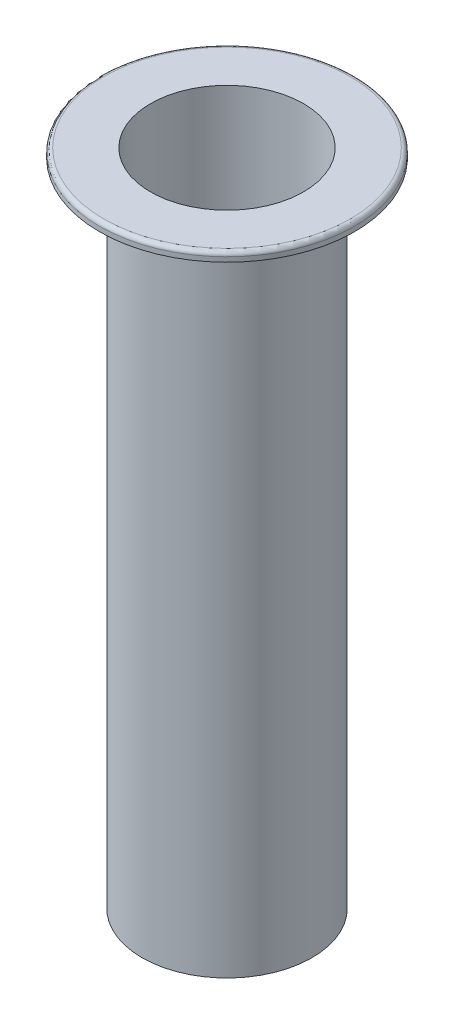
from build123d import *

# Parameters (mm, degrees)
CROQUIS1_R              = 20
SALIENTE_EXTRUIR1_DEPTH = 150
CROQUIS2_R              = 30
SALIENTE_EXTRUIR2_DEPTH = 5
CROQUIS3_R              = 18
CORTAR_EXTRUIR1_DEPTH   = 161.7015868
CHAFL_N1_SIZE           = 5
CHAFL_N1_SIZE2          = 2.886751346
REDONDEO1_R             = 1


with BuildPart() as part:
    # Croquis1 → Saliente-Extruir1 (new body)
    with BuildSketch(Plane(origin=(0, 0, 0), x_dir=(1, 0, 0), z_dir=(0, 1, 0))):
        with Locations(Location((0, 0, 0), (0, 0, 270))):
            Circle(CROQUIS1_R)
    extrude(amount=-SALIENTE_EXTRUIR1_DEPTH)

    # Croquis2 → Saliente-Extruir2 (add)
    with BuildSketch(Plane(origin=(0, 0, 0), x_dir=(1, 0, 0), z_dir=(0, 1, 0))):
        with Locations(Location((0, 0, 0), (0, 0, 270))):
            Circle(CROQUIS2_R)
    extrude(amount=SALIENTE_EXTRUIR2_DEPTH)

    # Croquis3 → Cortar-Extruir1 (cut, through all)
    with BuildSketch(Plane.XZ.offset(150)):
        with Locations(Location((0, 0, 0), (0, 0, 270))):
            Circle(CROQUIS3_R)
    extrude(amount=-CORTAR_EXTRUIR1_DEPTH, mode=Mode.SUBTRACT)

    # Chafl_n1
    chafl_n1_edges = [part.edges().sort_by_distance(p)[0] for p in [
        (0, 0, -30),
    ]]
    chafl_n1_side = [part.faces().sort_by_distance(p)[0] for p in [
        (0, 0, -29.151471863),
    ]]
    chamfer(chafl_n1_edges, length=CHAFL_N1_SIZE, length2=CHAFL_N1_SIZE2, reference=chafl_n1_side[0])

    # Redondeo1
    redondeo1_edges = [part.edges().sort_by_distance(p)[0] for p in [
        (0, 5, -30),
    ]]
    fillet(redondeo1_edges, radius=REDONDEO1_R)


solid = part.part
